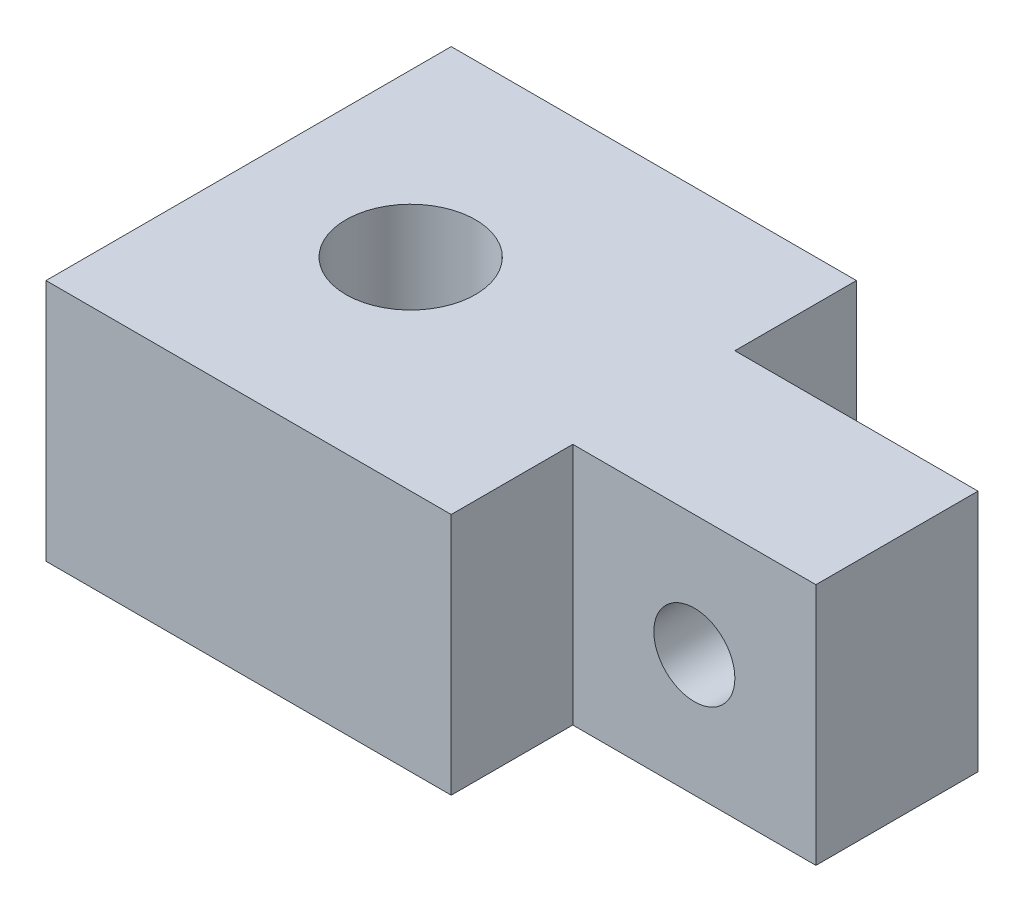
ISO-10303-21;
HEADER;
FILE_DESCRIPTION(('STEP AP214'),'2;1');
FILE_NAME('part.step','',(''),(''),'','','');
FILE_SCHEMA(('AUTOMOTIVE_DESIGN { 1 0 10303 214 1 1 1 1 }'));
ENDSEC;
DATA;
#1=APPLICATION_CONTEXT('core data for automotive mechanical design processes');
#2=APPLICATION_PROTOCOL_DEFINITION('international standard','automotive_design',2000,#1);
#3=PRODUCT_CONTEXT('',#1,'mechanical');
#4=PRODUCT('Part','Part','',(#3));
#5=PRODUCT_RELATED_PRODUCT_CATEGORY('part','',(#4));
#6=PRODUCT_DEFINITION_FORMATION('','',#4);
#7=PRODUCT_DEFINITION_CONTEXT('part definition',#1,'design');
#8=PRODUCT_DEFINITION('design','',#6,#7);
#9=PRODUCT_DEFINITION_SHAPE('','',#8);
#10=(LENGTH_UNIT() NAMED_UNIT(*) SI_UNIT(.MILLI.,.METRE.));
#11=(NAMED_UNIT(*) PLANE_ANGLE_UNIT() SI_UNIT($,.RADIAN.));
#12=(NAMED_UNIT(*) SI_UNIT($,.STERADIAN.) SOLID_ANGLE_UNIT());
#13=UNCERTAINTY_MEASURE_WITH_UNIT(LENGTH_MEASURE(1.E-05),#10,'distance_accuracy_value','');
#14=(GEOMETRIC_REPRESENTATION_CONTEXT(3) GLOBAL_UNCERTAINTY_ASSIGNED_CONTEXT((#13)) GLOBAL_UNIT_ASSIGNED_CONTEXT((#10,
#11,#12)) REPRESENTATION_CONTEXT('',''));
#15=CARTESIAN_POINT('',(0.,0.,0.));
#16=DIRECTION('',(0.,0.,1.));
#17=DIRECTION('',(1.,0.,0.));
#18=AXIS2_PLACEMENT_3D('',#15,#16,#17);
#19=CARTESIAN_POINT('',(0.,0.,0.));
#20=DIRECTION('',(0.,1.,0.));
#21=DIRECTION('',(0.,0.,1.));
#22=AXIS2_PLACEMENT_3D('',#19,#20,#21);
#23=PLANE('',#22);
#24=DIRECTION('',(0.,0.,1.));
#25=VECTOR('',#24,1.);
#26=CARTESIAN_POINT('',(-1.75552136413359,0.,-2.90604026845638));
#27=LINE('',#26,#25);
#28=CARTESIAN_POINT('',(-1.75552136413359,0.,-2.90604026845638));
#29=VERTEX_POINT('',#28);
#30=CARTESIAN_POINT('',(-1.75552136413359,0.,2.09395973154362));
#31=VERTEX_POINT('',#30);
#32=EDGE_CURVE('E137',#29,#31,#27,.T.);
#33=ORIENTED_EDGE('',*,*,#32,.F.);
#34=DIRECTION('',(-1.,0.,0.));
#35=VECTOR('',#34,1.);
#36=CARTESIAN_POINT('',(-1.75552136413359,0.,-2.90604026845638));
#37=LINE('',#36,#35);
#38=CARTESIAN_POINT('',(3.24447863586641,0.,-2.90604026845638));
#39=VERTEX_POINT('',#38);
#40=EDGE_CURVE('E92',#39,#29,#37,.T.);
#41=ORIENTED_EDGE('',*,*,#40,.F.);
#42=DIRECTION('',(0.,0.,-1.));
#43=VECTOR('',#42,1.);
#44=CARTESIAN_POINT('',(3.24447863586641,0.,-2.90604026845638));
#45=LINE('',#44,#43);
#46=CARTESIAN_POINT('',(3.24447863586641,0.,-1.40604026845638));
#47=VERTEX_POINT('',#46);
#48=EDGE_CURVE('E86',#47,#39,#45,.T.);
#49=ORIENTED_EDGE('',*,*,#48,.F.);
#50=DIRECTION('',(-1.,0.,0.));
#51=VECTOR('',#50,1.);
#52=CARTESIAN_POINT('',(3.24447863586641,0.,-1.40604026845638));
#53=LINE('',#52,#51);
#54=CARTESIAN_POINT('',(6.24447863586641,0.,-1.40604026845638));
#55=VERTEX_POINT('',#54);
#56=EDGE_CURVE('E127',#55,#47,#53,.T.);
#57=ORIENTED_EDGE('',*,*,#56,.F.);
#58=DIRECTION('',(0.,0.,-1.));
#59=VECTOR('',#58,1.);
#60=CARTESIAN_POINT('',(6.24447863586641,0.,-1.40604026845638));
#61=LINE('',#60,#59);
#62=CARTESIAN_POINT('',(6.24447863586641,0.,0.593959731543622));
#63=VERTEX_POINT('',#62);
#64=EDGE_CURVE('E147',#63,#55,#61,.T.);
#65=ORIENTED_EDGE('',*,*,#64,.F.);
#66=DIRECTION('',(1.,0.,0.));
#67=VECTOR('',#66,1.);
#68=CARTESIAN_POINT('',(6.24447863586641,0.,0.593959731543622));
#69=LINE('',#68,#67);
#70=CARTESIAN_POINT('',(3.24447863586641,0.,0.593959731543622));
#71=VERTEX_POINT('',#70);
#72=EDGE_CURVE('E145',#71,#63,#69,.T.);
#73=ORIENTED_EDGE('',*,*,#72,.F.);
#74=DIRECTION('',(0.,0.,-1.));
#75=VECTOR('',#74,1.);
#76=CARTESIAN_POINT('',(3.24447863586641,0.,0.593959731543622));
#77=LINE('',#76,#75);
#78=CARTESIAN_POINT('',(3.24447863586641,0.,2.09395973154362));
#79=VERTEX_POINT('',#78);
#80=EDGE_CURVE('E143',#79,#71,#77,.T.);
#81=ORIENTED_EDGE('',*,*,#80,.F.);
#82=DIRECTION('',(1.,0.,0.));
#83=VECTOR('',#82,1.);
#84=CARTESIAN_POINT('',(-1.75552136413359,0.,2.09395973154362));
#85=LINE('',#84,#83);
#86=EDGE_CURVE('E140',#31,#79,#85,.T.);
#87=ORIENTED_EDGE('',*,*,#86,.F.);
#88=EDGE_LOOP('',(#33,#41,#49,#57,#65,#73,#81,#87));
#89=FACE_BOUND('',#88,.T.);
#90=CARTESIAN_POINT('',(0.24447863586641,0.,-0.406040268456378));
#91=DIRECTION('',(0.,1.,0.));
#92=DIRECTION('',(0.,0.,1.));
#93=AXIS2_PLACEMENT_3D('',#90,#91,#92);
#94=CIRCLE('',#93,0.799999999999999);
#95=CARTESIAN_POINT('',(0.24447863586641,0.,0.393959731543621));
#96=VERTEX_POINT('',#95);
#97=EDGE_CURVE('E190',#96,#96,#94,.F.);
#98=ORIENTED_EDGE('',*,*,#97,.F.);
#99=EDGE_LOOP('',(#98));
#100=FACE_BOUND('',#99,.T.);
#101=ADVANCED_FACE('F40',(#89,#100),#23,.F.);
#102=CARTESIAN_POINT('',(-1.75552136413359,3.,-2.90604026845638));
#103=DIRECTION('',(1.,0.,0.));
#104=DIRECTION('',(0.,0.,-1.));
#105=AXIS2_PLACEMENT_3D('',#102,#103,#104);
#106=PLANE('',#105);
#107=ORIENTED_EDGE('',*,*,#32,.T.);
#108=DIRECTION('',(0.,-1.,0.));
#109=VECTOR('',#108,1.);
#110=CARTESIAN_POINT('',(-1.75552136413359,3.,2.09395973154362));
#111=LINE('',#110,#109);
#112=CARTESIAN_POINT('',(-1.75552136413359,3.,2.09395973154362));
#113=VERTEX_POINT('',#112);
#114=EDGE_CURVE('E11',#113,#31,#111,.T.);
#115=ORIENTED_EDGE('',*,*,#114,.F.);
#116=DIRECTION('',(0.,0.,1.));
#117=VECTOR('',#116,1.);
#118=CARTESIAN_POINT('',(-1.75552136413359,3.,-2.90604026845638));
#119=LINE('',#118,#117);
#120=CARTESIAN_POINT('',(-1.75552136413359,3.,-2.90604026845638));
#121=VERTEX_POINT('',#120);
#122=EDGE_CURVE('E152',#121,#113,#119,.T.);
#123=ORIENTED_EDGE('',*,*,#122,.F.);
#124=DIRECTION('',(0.,-1.,0.));
#125=VECTOR('',#124,1.);
#126=CARTESIAN_POINT('',(-1.75552136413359,3.,-2.90604026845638));
#127=LINE('',#126,#125);
#128=EDGE_CURVE('E133',#121,#29,#127,.T.);
#129=ORIENTED_EDGE('',*,*,#128,.T.);
#130=EDGE_LOOP('',(#107,#115,#123,#129));
#131=FACE_BOUND('',#130,.T.);
#132=ADVANCED_FACE('F42',(#131),#106,.F.);
#133=CARTESIAN_POINT('',(-1.75552136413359,3.,2.09395973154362));
#134=DIRECTION('',(0.,0.,-1.));
#135=DIRECTION('',(-1.,0.,0.));
#136=AXIS2_PLACEMENT_3D('',#133,#134,#135);
#137=PLANE('',#136);
#138=ORIENTED_EDGE('',*,*,#86,.T.);
#139=DIRECTION('',(0.,-1.,0.));
#140=VECTOR('',#139,1.);
#141=CARTESIAN_POINT('',(3.24447863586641,3.,2.09395973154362));
#142=LINE('',#141,#140);
#143=CARTESIAN_POINT('',(3.24447863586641,3.,2.09395973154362));
#144=VERTEX_POINT('',#143);
#145=EDGE_CURVE('E49',#144,#79,#142,.T.);
#146=ORIENTED_EDGE('',*,*,#145,.F.);
#147=DIRECTION('',(1.,0.,0.));
#148=VECTOR('',#147,1.);
#149=CARTESIAN_POINT('',(-1.75552136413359,3.,2.09395973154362));
#150=LINE('',#149,#148);
#151=EDGE_CURVE('E100',#113,#144,#150,.T.);
#152=ORIENTED_EDGE('',*,*,#151,.F.);
#153=ORIENTED_EDGE('',*,*,#114,.T.);
#154=EDGE_LOOP('',(#138,#146,#152,#153));
#155=FACE_BOUND('',#154,.T.);
#156=ADVANCED_FACE('F204',(#155),#137,.F.);
#157=CARTESIAN_POINT('',(3.24447863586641,3.,0.593959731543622));
#158=DIRECTION('',(-1.,0.,0.));
#159=DIRECTION('',(0.,0.,1.));
#160=AXIS2_PLACEMENT_3D('',#157,#158,#159);
#161=PLANE('',#160);
#162=ORIENTED_EDGE('',*,*,#80,.T.);
#163=DIRECTION('',(0.,-1.,0.));
#164=VECTOR('',#163,1.);
#165=CARTESIAN_POINT('',(3.24447863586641,3.,0.593959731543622));
#166=LINE('',#165,#164);
#167=CARTESIAN_POINT('',(3.24447863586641,3.,0.593959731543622));
#168=VERTEX_POINT('',#167);
#169=EDGE_CURVE('E159',#168,#71,#166,.T.);
#170=ORIENTED_EDGE('',*,*,#169,.F.);
#171=DIRECTION('',(0.,0.,-1.));
#172=VECTOR('',#171,1.);
#173=CARTESIAN_POINT('',(3.24447863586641,3.,0.593959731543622));
#174=LINE('',#173,#172);
#175=EDGE_CURVE('E167',#144,#168,#174,.T.);
#176=ORIENTED_EDGE('',*,*,#175,.F.);
#177=ORIENTED_EDGE('',*,*,#145,.T.);
#178=EDGE_LOOP('',(#162,#170,#176,#177));
#179=FACE_BOUND('',#178,.T.);
#180=ADVANCED_FACE('F165',(#179),#161,.F.);
#181=CARTESIAN_POINT('',(6.24447863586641,3.,0.593959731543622));
#182=DIRECTION('',(0.,0.,-1.));
#183=DIRECTION('',(-1.,0.,0.));
#184=AXIS2_PLACEMENT_3D('',#181,#182,#183);
#185=PLANE('',#184);
#186=CARTESIAN_POINT('',(4.74447863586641,1.5,0.593959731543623));
#187=DIRECTION('',(0.,0.,1.));
#188=DIRECTION('',(1.,0.,0.));
#189=AXIS2_PLACEMENT_3D('',#186,#187,#188);
#190=CIRCLE('',#189,0.500000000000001);
#191=CARTESIAN_POINT('',(5.24447863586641,1.5,0.593959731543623));
#192=VERTEX_POINT('',#191);
#193=EDGE_CURVE('E187',#192,#192,#190,.T.);
#194=ORIENTED_EDGE('',*,*,#193,.F.);
#195=EDGE_LOOP('',(#194));
#196=FACE_BOUND('',#195,.T.);
#197=ORIENTED_EDGE('',*,*,#72,.T.);
#198=DIRECTION('',(0.,-1.,0.));
#199=VECTOR('',#198,1.);
#200=CARTESIAN_POINT('',(6.24447863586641,3.,0.593959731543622));
#201=LINE('',#200,#199);
#202=CARTESIAN_POINT('',(6.24447863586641,3.,0.593959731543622));
#203=VERTEX_POINT('',#202);
#204=EDGE_CURVE('E156',#203,#63,#201,.T.);
#205=ORIENTED_EDGE('',*,*,#204,.F.);
#206=DIRECTION('',(1.,0.,0.));
#207=VECTOR('',#206,1.);
#208=CARTESIAN_POINT('',(6.24447863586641,3.,0.593959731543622));
#209=LINE('',#208,#207);
#210=EDGE_CURVE('E179',#168,#203,#209,.T.);
#211=ORIENTED_EDGE('',*,*,#210,.F.);
#212=ORIENTED_EDGE('',*,*,#169,.T.);
#213=EDGE_LOOP('',(#197,#205,#211,#212));
#214=FACE_BOUND('',#213,.T.);
#215=ADVANCED_FACE('F175',(#196,#214),#185,.F.);
#216=CARTESIAN_POINT('',(6.24447863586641,3.,-1.40604026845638));
#217=DIRECTION('',(-1.,0.,0.));
#218=DIRECTION('',(0.,0.,1.));
#219=AXIS2_PLACEMENT_3D('',#216,#217,#218);
#220=PLANE('',#219);
#221=ORIENTED_EDGE('',*,*,#64,.T.);
#222=DIRECTION('',(0.,-1.,0.));
#223=VECTOR('',#222,1.);
#224=CARTESIAN_POINT('',(6.24447863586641,3.,-1.40604026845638));
#225=LINE('',#224,#223);
#226=CARTESIAN_POINT('',(6.24447863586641,3.,-1.40604026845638));
#227=VERTEX_POINT('',#226);
#228=EDGE_CURVE('E128',#227,#55,#225,.T.);
#229=ORIENTED_EDGE('',*,*,#228,.F.);
#230=DIRECTION('',(0.,0.,-1.));
#231=VECTOR('',#230,1.);
#232=CARTESIAN_POINT('',(6.24447863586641,3.,-1.40604026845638));
#233=LINE('',#232,#231);
#234=EDGE_CURVE('E119',#203,#227,#233,.T.);
#235=ORIENTED_EDGE('',*,*,#234,.F.);
#236=ORIENTED_EDGE('',*,*,#204,.T.);
#237=EDGE_LOOP('',(#221,#229,#235,#236));
#238=FACE_BOUND('',#237,.T.);
#239=ADVANCED_FACE('F178',(#238),#220,.F.);
#240=CARTESIAN_POINT('',(3.24447863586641,3.,-1.40604026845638));
#241=DIRECTION('',(0.,0.,1.));
#242=DIRECTION('',(1.,0.,0.));
#243=AXIS2_PLACEMENT_3D('',#240,#241,#242);
#244=PLANE('',#243);
#245=CARTESIAN_POINT('',(4.74447863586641,1.5,-1.40604026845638));
#246=DIRECTION('',(0.,0.,1.));
#247=DIRECTION('',(1.,0.,0.));
#248=AXIS2_PLACEMENT_3D('',#245,#246,#247);
#249=CIRCLE('',#248,0.500000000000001);
#250=CARTESIAN_POINT('',(5.24447863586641,1.5,-1.40604026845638));
#251=VERTEX_POINT('',#250);
#252=EDGE_CURVE('E141',#251,#251,#249,.F.);
#253=ORIENTED_EDGE('',*,*,#252,.F.);
#254=EDGE_LOOP('',(#253));
#255=FACE_BOUND('',#254,.T.);
#256=ORIENTED_EDGE('',*,*,#56,.T.);
#257=DIRECTION('',(0.,-1.,0.));
#258=VECTOR('',#257,1.);
#259=CARTESIAN_POINT('',(3.24447863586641,3.,-1.40604026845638));
#260=LINE('',#259,#258);
#261=CARTESIAN_POINT('',(3.24447863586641,3.,-1.40604026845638));
#262=VERTEX_POINT('',#261);
#263=EDGE_CURVE('E124',#262,#47,#260,.T.);
#264=ORIENTED_EDGE('',*,*,#263,.F.);
#265=DIRECTION('',(-1.,0.,0.));
#266=VECTOR('',#265,1.);
#267=CARTESIAN_POINT('',(3.24447863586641,3.,-1.40604026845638));
#268=LINE('',#267,#266);
#269=EDGE_CURVE('E113',#227,#262,#268,.T.);
#270=ORIENTED_EDGE('',*,*,#269,.F.);
#271=ORIENTED_EDGE('',*,*,#228,.T.);
#272=EDGE_LOOP('',(#256,#264,#270,#271));
#273=FACE_BOUND('',#272,.T.);
#274=ADVANCED_FACE('F125',(#255,#273),#244,.F.);
#275=CARTESIAN_POINT('',(3.24447863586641,3.,-2.90604026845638));
#276=DIRECTION('',(-1.,0.,0.));
#277=DIRECTION('',(0.,0.,1.));
#278=AXIS2_PLACEMENT_3D('',#275,#276,#277);
#279=PLANE('',#278);
#280=ORIENTED_EDGE('',*,*,#48,.T.);
#281=DIRECTION('',(0.,-1.,0.));
#282=VECTOR('',#281,1.);
#283=CARTESIAN_POINT('',(3.24447863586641,3.,-2.90604026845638));
#284=LINE('',#283,#282);
#285=CARTESIAN_POINT('',(3.24447863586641,3.,-2.90604026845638));
#286=VERTEX_POINT('',#285);
#287=EDGE_CURVE('E129',#286,#39,#284,.T.);
#288=ORIENTED_EDGE('',*,*,#287,.F.);
#289=DIRECTION('',(0.,0.,-1.));
#290=VECTOR('',#289,1.);
#291=CARTESIAN_POINT('',(3.24447863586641,3.,-2.90604026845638));
#292=LINE('',#291,#290);
#293=EDGE_CURVE('E117',#262,#286,#292,.T.);
#294=ORIENTED_EDGE('',*,*,#293,.F.);
#295=ORIENTED_EDGE('',*,*,#263,.T.);
#296=EDGE_LOOP('',(#280,#288,#294,#295));
#297=FACE_BOUND('',#296,.T.);
#298=ADVANCED_FACE('F131',(#297),#279,.F.);
#299=CARTESIAN_POINT('',(-1.75552136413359,3.,-2.90604026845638));
#300=DIRECTION('',(0.,0.,1.));
#301=DIRECTION('',(1.,0.,0.));
#302=AXIS2_PLACEMENT_3D('',#299,#300,#301);
#303=PLANE('',#302);
#304=ORIENTED_EDGE('',*,*,#40,.T.);
#305=ORIENTED_EDGE('',*,*,#128,.F.);
#306=DIRECTION('',(-1.,0.,0.));
#307=VECTOR('',#306,1.);
#308=CARTESIAN_POINT('',(-1.75552136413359,3.,-2.90604026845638));
#309=LINE('',#308,#307);
#310=EDGE_CURVE('E57',#286,#121,#309,.T.);
#311=ORIENTED_EDGE('',*,*,#310,.F.);
#312=ORIENTED_EDGE('',*,*,#287,.T.);
#313=EDGE_LOOP('',(#304,#305,#311,#312));
#314=FACE_BOUND('',#313,.T.);
#315=ADVANCED_FACE('F209',(#314),#303,.F.);
#316=CARTESIAN_POINT('',(0.,3.,0.));
#317=DIRECTION('',(0.,1.,0.));
#318=DIRECTION('',(0.,0.,1.));
#319=AXIS2_PLACEMENT_3D('',#316,#317,#318);
#320=PLANE('',#319);
#321=CARTESIAN_POINT('',(0.24447863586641,3.,-0.406040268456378));
#322=DIRECTION('',(0.,1.,0.));
#323=DIRECTION('',(0.,0.,1.));
#324=AXIS2_PLACEMENT_3D('',#321,#322,#323);
#325=CIRCLE('',#324,0.799999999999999);
#326=CARTESIAN_POINT('',(0.24447863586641,3.,0.393959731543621));
#327=VERTEX_POINT('',#326);
#328=EDGE_CURVE('E191',#327,#327,#325,.T.);
#329=ORIENTED_EDGE('',*,*,#328,.F.);
#330=EDGE_LOOP('',(#329));
#331=FACE_BOUND('',#330,.T.);
#332=ORIENTED_EDGE('',*,*,#122,.T.);
#333=ORIENTED_EDGE('',*,*,#151,.T.);
#334=ORIENTED_EDGE('',*,*,#175,.T.);
#335=ORIENTED_EDGE('',*,*,#210,.T.);
#336=ORIENTED_EDGE('',*,*,#234,.T.);
#337=ORIENTED_EDGE('',*,*,#269,.T.);
#338=ORIENTED_EDGE('',*,*,#293,.T.);
#339=ORIENTED_EDGE('',*,*,#310,.T.);
#340=EDGE_LOOP('',(#332,#333,#334,#335,#336,#337,#338,#339));
#341=FACE_BOUND('',#340,.T.);
#342=ADVANCED_FACE('F115',(#331,#341),#320,.T.);
#343=CARTESIAN_POINT('',(4.74447863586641,1.5,-2.90704026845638));
#344=DIRECTION('',(0.,0.,1.));
#345=DIRECTION('',(1.,0.,0.));
#346=AXIS2_PLACEMENT_3D('',#343,#344,#345);
#347=CYLINDRICAL_SURFACE('',#346,0.500000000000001);
#348=ORIENTED_EDGE('',*,*,#193,.T.);
#349=EDGE_LOOP('',(#348));
#350=FACE_BOUND('',#349,.T.);
#351=ORIENTED_EDGE('',*,*,#252,.T.);
#352=EDGE_LOOP('',(#351));
#353=FACE_BOUND('',#352,.T.);
#354=ADVANCED_FACE('F263',(#350,#353),#347,.F.);
#355=CARTESIAN_POINT('',(0.24447863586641,3.,-0.406040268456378));
#356=DIRECTION('',(0.,1.,0.));
#357=DIRECTION('',(0.,0.,1.));
#358=AXIS2_PLACEMENT_3D('',#355,#356,#357);
#359=CYLINDRICAL_SURFACE('',#358,0.799999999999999);
#360=ORIENTED_EDGE('',*,*,#97,.T.);
#361=EDGE_LOOP('',(#360));
#362=FACE_BOUND('',#361,.T.);
#363=ORIENTED_EDGE('',*,*,#328,.T.);
#364=EDGE_LOOP('',(#363));
#365=FACE_BOUND('',#364,.T.);
#366=ADVANCED_FACE('F197',(#362,#365),#359,.F.);
#367=CLOSED_SHELL('',(#101,#132,#156,#180,#215,#239,#274,#298,#315,#342,#354,#366));
#368=MANIFOLD_SOLID_BREP('B2',#367);
#369=ADVANCED_BREP_SHAPE_REPRESENTATION('',(#18,#368),#14);
#370=SHAPE_DEFINITION_REPRESENTATION(#9,#369);
ENDSEC;
END-ISO-10303-21;
